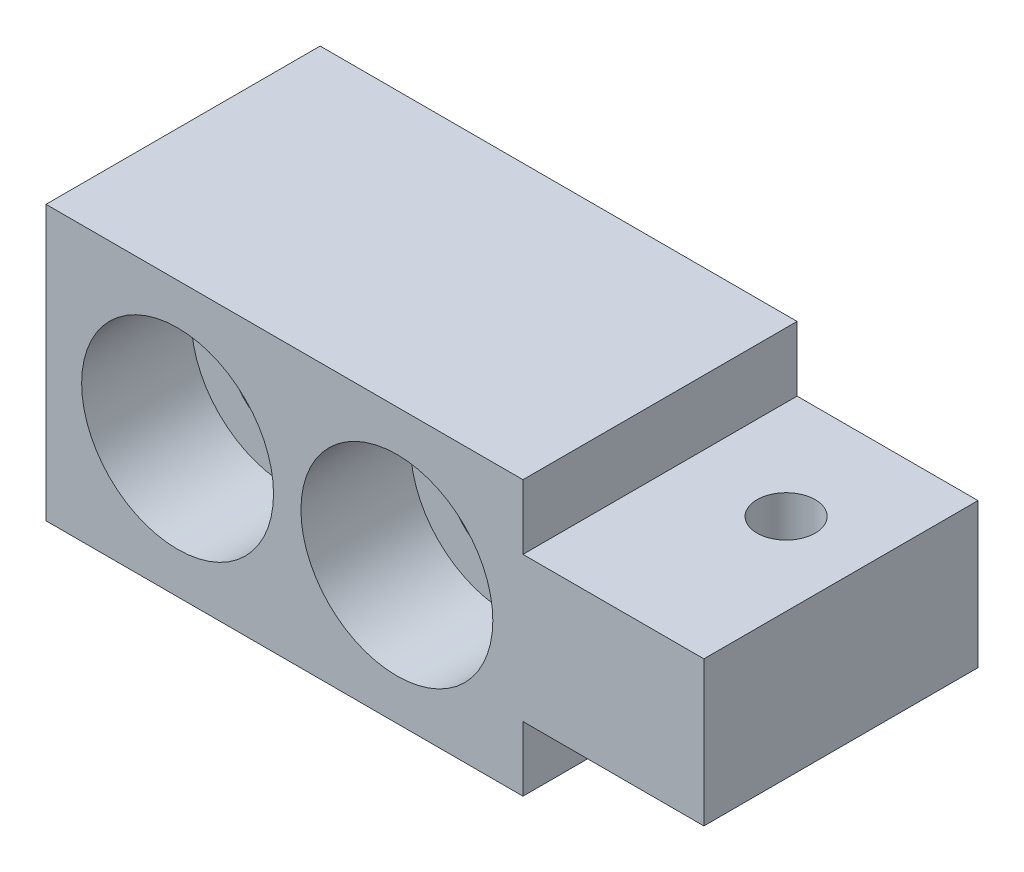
ISO-10303-21;
HEADER;
FILE_DESCRIPTION(('STEP AP214'),'2;1');
FILE_NAME('part.step','',(''),(''),'','','');
FILE_SCHEMA(('AUTOMOTIVE_DESIGN { 1 0 10303 214 1 1 1 1 }'));
ENDSEC;
DATA;
#1=APPLICATION_CONTEXT('core data for automotive mechanical design processes');
#2=APPLICATION_PROTOCOL_DEFINITION('international standard','automotive_design',2000,#1);
#3=PRODUCT_CONTEXT('',#1,'mechanical');
#4=PRODUCT('Part','Part','',(#3));
#5=PRODUCT_RELATED_PRODUCT_CATEGORY('part','',(#4));
#6=PRODUCT_DEFINITION_FORMATION('','',#4);
#7=PRODUCT_DEFINITION_CONTEXT('part definition',#1,'design');
#8=PRODUCT_DEFINITION('design','',#6,#7);
#9=PRODUCT_DEFINITION_SHAPE('','',#8);
#10=(LENGTH_UNIT() NAMED_UNIT(*) SI_UNIT(.MILLI.,.METRE.));
#11=(NAMED_UNIT(*) PLANE_ANGLE_UNIT() SI_UNIT($,.RADIAN.));
#12=(NAMED_UNIT(*) SI_UNIT($,.STERADIAN.) SOLID_ANGLE_UNIT());
#13=UNCERTAINTY_MEASURE_WITH_UNIT(LENGTH_MEASURE(1.E-05),#10,'distance_accuracy_value','');
#14=(GEOMETRIC_REPRESENTATION_CONTEXT(3) GLOBAL_UNCERTAINTY_ASSIGNED_CONTEXT((#13)) GLOBAL_UNIT_ASSIGNED_CONTEXT((#10,
#11,#12)) REPRESENTATION_CONTEXT('',''));
#15=CARTESIAN_POINT('',(0.,0.,0.));
#16=DIRECTION('',(0.,0.,1.));
#17=DIRECTION('',(1.,0.,0.));
#18=AXIS2_PLACEMENT_3D('',#15,#16,#17);
#19=CARTESIAN_POINT('',(48.,12.5,25.));
#20=DIRECTION('',(0.,0.,-1.));
#21=DIRECTION('',(1.,0.,0.));
#22=AXIS2_PLACEMENT_3D('',#19,#20,#21);
#23=PLANE('',#22);
#24=CARTESIAN_POINT('',(0.,0.,25.));
#25=DIRECTION('',(0.,0.,1.));
#26=DIRECTION('',(-1.,0.,0.));
#27=AXIS2_PLACEMENT_3D('',#24,#25,#26);
#28=CIRCLE('',#27,8.75);
#29=CARTESIAN_POINT('',(-8.75,0.,25.));
#30=VERTEX_POINT('',#29);
#31=EDGE_CURVE('E157',#30,#30,#28,.T.);
#32=ORIENTED_EDGE('',*,*,#31,.F.);
#33=EDGE_LOOP('',(#32));
#34=FACE_BOUND('',#33,.T.);
#35=DIRECTION('',(0.,1.,0.));
#36=VECTOR('',#35,1.);
#37=CARTESIAN_POINT('',(31.5,6.6,25.));
#38=LINE('',#37,#36);
#39=CARTESIAN_POINT('',(31.5,6.6,25.));
#40=VERTEX_POINT('',#39);
#41=CARTESIAN_POINT('',(31.5,12.5,25.));
#42=VERTEX_POINT('',#41);
#43=EDGE_CURVE('E88',#40,#42,#38,.T.);
#44=ORIENTED_EDGE('',*,*,#43,.T.);
#45=DIRECTION('',(-1.,0.,0.));
#46=VECTOR('',#45,1.);
#47=CARTESIAN_POINT('',(48.,12.5,25.));
#48=LINE('',#47,#46);
#49=CARTESIAN_POINT('',(-12.,12.5,25.));
#50=VERTEX_POINT('',#49);
#51=EDGE_CURVE('E22',#42,#50,#48,.T.);
#52=ORIENTED_EDGE('',*,*,#51,.T.);
#53=DIRECTION('',(0.,-1.,0.));
#54=VECTOR('',#53,1.);
#55=CARTESIAN_POINT('',(-12.,12.5,25.));
#56=LINE('',#55,#54);
#57=CARTESIAN_POINT('',(-12.,-12.5,25.));
#58=VERTEX_POINT('',#57);
#59=EDGE_CURVE('E129',#50,#58,#56,.T.);
#60=ORIENTED_EDGE('',*,*,#59,.T.);
#61=DIRECTION('',(-1.,0.,0.));
#62=VECTOR('',#61,1.);
#63=CARTESIAN_POINT('',(48.,-12.5,25.));
#64=LINE('',#63,#62);
#65=CARTESIAN_POINT('',(31.5,-12.5,25.));
#66=VERTEX_POINT('',#65);
#67=EDGE_CURVE('E140',#66,#58,#64,.T.);
#68=ORIENTED_EDGE('',*,*,#67,.F.);
#69=DIRECTION('',(0.,-1.,0.));
#70=VECTOR('',#69,1.);
#71=CARTESIAN_POINT('',(31.5,-6.6,25.));
#72=LINE('',#71,#70);
#73=CARTESIAN_POINT('',(31.5,-6.6,25.));
#74=VERTEX_POINT('',#73);
#75=EDGE_CURVE('E108',#74,#66,#72,.T.);
#76=ORIENTED_EDGE('',*,*,#75,.F.);
#77=DIRECTION('',(1.,0.,0.));
#78=VECTOR('',#77,1.);
#79=CARTESIAN_POINT('',(31.5,-6.6,25.));
#80=LINE('',#79,#78);
#81=CARTESIAN_POINT('',(48.,-6.6,25.));
#82=VERTEX_POINT('',#81);
#83=EDGE_CURVE('E110',#74,#82,#80,.T.);
#84=ORIENTED_EDGE('',*,*,#83,.T.);
#85=DIRECTION('',(0.,-1.,0.));
#86=VECTOR('',#85,1.);
#87=CARTESIAN_POINT('',(48.,12.5,25.));
#88=LINE('',#87,#86);
#89=CARTESIAN_POINT('',(48.,6.6,25.));
#90=VERTEX_POINT('',#89);
#91=EDGE_CURVE('E99',#90,#82,#88,.T.);
#92=ORIENTED_EDGE('',*,*,#91,.F.);
#93=DIRECTION('',(1.,0.,0.));
#94=VECTOR('',#93,1.);
#95=CARTESIAN_POINT('',(31.5,6.6,25.));
#96=LINE('',#95,#94);
#97=EDGE_CURVE('E82',#40,#90,#96,.T.);
#98=ORIENTED_EDGE('',*,*,#97,.F.);
#99=EDGE_LOOP('',(#44,#52,#60,#68,#76,#84,#92,#98));
#100=FACE_BOUND('',#99,.T.);
#101=CARTESIAN_POINT('',(20.,0.,25.));
#102=DIRECTION('',(0.,0.,1.));
#103=DIRECTION('',(-1.,0.,0.));
#104=AXIS2_PLACEMENT_3D('',#101,#102,#103);
#105=CIRCLE('',#104,8.75);
#106=CARTESIAN_POINT('',(11.25,0.,25.));
#107=VERTEX_POINT('',#106);
#108=EDGE_CURVE('E168',#107,#107,#105,.T.);
#109=ORIENTED_EDGE('',*,*,#108,.F.);
#110=EDGE_LOOP('',(#109));
#111=FACE_BOUND('',#110,.T.);
#112=ADVANCED_FACE('F14',(#34,#100,#111),#23,.F.);
#113=CARTESIAN_POINT('',(48.,-12.5,0.));
#114=DIRECTION('',(0.,0.,1.));
#115=DIRECTION('',(0.,1.,0.));
#116=AXIS2_PLACEMENT_3D('',#113,#114,#115);
#117=PLANE('',#116);
#118=CARTESIAN_POINT('',(0.,0.,0.));
#119=DIRECTION('',(0.,0.,1.));
#120=DIRECTION('',(0.,1.,0.));
#121=AXIS2_PLACEMENT_3D('',#118,#119,#120);
#122=CIRCLE('',#121,5.5);
#123=CARTESIAN_POINT('',(0.,5.5,0.));
#124=VERTEX_POINT('',#123);
#125=EDGE_CURVE('E145',#124,#124,#122,.F.);
#126=ORIENTED_EDGE('',*,*,#125,.F.);
#127=EDGE_LOOP('',(#126));
#128=FACE_BOUND('',#127,.T.);
#129=DIRECTION('',(0.,1.,0.));
#130=VECTOR('',#129,1.);
#131=CARTESIAN_POINT('',(31.5,6.6,0.));
#132=LINE('',#131,#130);
#133=CARTESIAN_POINT('',(31.5,6.6,0.));
#134=VERTEX_POINT('',#133);
#135=CARTESIAN_POINT('',(31.5,12.5,0.));
#136=VERTEX_POINT('',#135);
#137=EDGE_CURVE('E100',#134,#136,#132,.T.);
#138=ORIENTED_EDGE('',*,*,#137,.F.);
#139=DIRECTION('',(1.,0.,0.));
#140=VECTOR('',#139,1.);
#141=CARTESIAN_POINT('',(31.5,6.6,0.));
#142=LINE('',#141,#140);
#143=CARTESIAN_POINT('',(48.,6.6,0.));
#144=VERTEX_POINT('',#143);
#145=EDGE_CURVE('E83',#134,#144,#142,.T.);
#146=ORIENTED_EDGE('',*,*,#145,.T.);
#147=DIRECTION('',(0.,1.,0.));
#148=VECTOR('',#147,1.);
#149=CARTESIAN_POINT('',(48.,-12.5,0.));
#150=LINE('',#149,#148);
#151=CARTESIAN_POINT('',(48.,-6.6,0.));
#152=VERTEX_POINT('',#151);
#153=EDGE_CURVE('E132',#152,#144,#150,.T.);
#154=ORIENTED_EDGE('',*,*,#153,.F.);
#155=DIRECTION('',(1.,0.,0.));
#156=VECTOR('',#155,1.);
#157=CARTESIAN_POINT('',(31.5,-6.6,0.));
#158=LINE('',#157,#156);
#159=CARTESIAN_POINT('',(31.5,-6.6,0.));
#160=VERTEX_POINT('',#159);
#161=EDGE_CURVE('E38',#160,#152,#158,.T.);
#162=ORIENTED_EDGE('',*,*,#161,.F.);
#163=DIRECTION('',(0.,-1.,0.));
#164=VECTOR('',#163,1.);
#165=CARTESIAN_POINT('',(31.5,-6.6,0.));
#166=LINE('',#165,#164);
#167=CARTESIAN_POINT('',(31.5,-12.5,0.));
#168=VERTEX_POINT('',#167);
#169=EDGE_CURVE('E112',#160,#168,#166,.T.);
#170=ORIENTED_EDGE('',*,*,#169,.T.);
#171=DIRECTION('',(-1.,0.,0.));
#172=VECTOR('',#171,1.);
#173=CARTESIAN_POINT('',(48.,-12.5,0.));
#174=LINE('',#173,#172);
#175=CARTESIAN_POINT('',(-12.,-12.5,0.));
#176=VERTEX_POINT('',#175);
#177=EDGE_CURVE('E138',#168,#176,#174,.T.);
#178=ORIENTED_EDGE('',*,*,#177,.T.);
#179=DIRECTION('',(0.,1.,0.));
#180=VECTOR('',#179,1.);
#181=CARTESIAN_POINT('',(-12.,-12.5,0.));
#182=LINE('',#181,#180);
#183=CARTESIAN_POINT('',(-12.,12.5,0.));
#184=VERTEX_POINT('',#183);
#185=EDGE_CURVE('E123',#176,#184,#182,.T.);
#186=ORIENTED_EDGE('',*,*,#185,.T.);
#187=DIRECTION('',(-1.,0.,0.));
#188=VECTOR('',#187,1.);
#189=CARTESIAN_POINT('',(48.,12.5,0.));
#190=LINE('',#189,#188);
#191=EDGE_CURVE('E136',#136,#184,#190,.T.);
#192=ORIENTED_EDGE('',*,*,#191,.F.);
#193=EDGE_LOOP('',(#138,#146,#154,#162,#170,#178,#186,#192));
#194=FACE_BOUND('',#193,.T.);
#195=CARTESIAN_POINT('',(20.,0.,0.));
#196=DIRECTION('',(0.,0.,1.));
#197=DIRECTION('',(0.,1.,0.));
#198=AXIS2_PLACEMENT_3D('',#195,#196,#197);
#199=CIRCLE('',#198,5.5);
#200=CARTESIAN_POINT('',(20.,5.5,0.));
#201=VERTEX_POINT('',#200);
#202=EDGE_CURVE('E17',#201,#201,#199,.F.);
#203=ORIENTED_EDGE('',*,*,#202,.F.);
#204=EDGE_LOOP('',(#203));
#205=FACE_BOUND('',#204,.T.);
#206=ADVANCED_FACE('F175',(#128,#194,#205),#117,.F.);
#207=CARTESIAN_POINT('',(48.,12.5,25.));
#208=DIRECTION('',(0.,1.,0.));
#209=DIRECTION('',(0.,0.,-1.));
#210=AXIS2_PLACEMENT_3D('',#207,#208,#209);
#211=PLANE('',#210);
#212=ORIENTED_EDGE('',*,*,#51,.F.);
#213=DIRECTION('',(0.,0.,-1.));
#214=VECTOR('',#213,1.);
#215=CARTESIAN_POINT('',(31.5,12.5,25.));
#216=LINE('',#215,#214);
#217=EDGE_CURVE('E91',#42,#136,#216,.T.);
#218=ORIENTED_EDGE('',*,*,#217,.T.);
#219=ORIENTED_EDGE('',*,*,#191,.T.);
#220=DIRECTION('',(0.,0.,-1.));
#221=VECTOR('',#220,1.);
#222=CARTESIAN_POINT('',(-12.,12.5,25.));
#223=LINE('',#222,#221);
#224=EDGE_CURVE('E120',#50,#184,#223,.T.);
#225=ORIENTED_EDGE('',*,*,#224,.F.);
#226=EDGE_LOOP('',(#212,#218,#219,#225));
#227=FACE_BOUND('',#226,.T.);
#228=ADVANCED_FACE('F182',(#227),#211,.T.);
#229=CARTESIAN_POINT('',(48.,12.5,0.));
#230=DIRECTION('',(1.,0.,0.));
#231=DIRECTION('',(0.,1.,0.));
#232=AXIS2_PLACEMENT_3D('',#229,#230,#231);
#233=PLANE('',#232);
#234=DIRECTION('',(0.,0.,-1.));
#235=VECTOR('',#234,1.);
#236=CARTESIAN_POINT('',(48.,6.6,0.));
#237=LINE('',#236,#235);
#238=EDGE_CURVE('E30',#90,#144,#237,.T.);
#239=ORIENTED_EDGE('',*,*,#238,.F.);
#240=ORIENTED_EDGE('',*,*,#91,.T.);
#241=DIRECTION('',(0.,0.,-1.));
#242=VECTOR('',#241,1.);
#243=CARTESIAN_POINT('',(48.,-6.6,0.));
#244=LINE('',#243,#242);
#245=EDGE_CURVE('E9',#82,#152,#244,.T.);
#246=ORIENTED_EDGE('',*,*,#245,.T.);
#247=ORIENTED_EDGE('',*,*,#153,.T.);
#248=EDGE_LOOP('',(#239,#240,#246,#247));
#249=FACE_BOUND('',#248,.T.);
#250=ADVANCED_FACE('F228',(#249),#233,.T.);
#251=CARTESIAN_POINT('',(48.,-12.5,0.));
#252=DIRECTION('',(0.,-1.,0.));
#253=DIRECTION('',(1.,0.,0.));
#254=AXIS2_PLACEMENT_3D('',#251,#252,#253);
#255=PLANE('',#254);
#256=DIRECTION('',(0.,0.,-1.));
#257=VECTOR('',#256,1.);
#258=CARTESIAN_POINT('',(31.5,-12.5,0.));
#259=LINE('',#258,#257);
#260=EDGE_CURVE('E118',#66,#168,#259,.T.);
#261=ORIENTED_EDGE('',*,*,#260,.F.);
#262=ORIENTED_EDGE('',*,*,#67,.T.);
#263=DIRECTION('',(0.,0.,1.));
#264=VECTOR('',#263,1.);
#265=CARTESIAN_POINT('',(-12.,-12.5,0.));
#266=LINE('',#265,#264);
#267=EDGE_CURVE('E126',#176,#58,#266,.T.);
#268=ORIENTED_EDGE('',*,*,#267,.F.);
#269=ORIENTED_EDGE('',*,*,#177,.F.);
#270=EDGE_LOOP('',(#261,#262,#268,#269));
#271=FACE_BOUND('',#270,.T.);
#272=ADVANCED_FACE('F226',(#271),#255,.T.);
#273=CARTESIAN_POINT('',(-12.,12.5,0.));
#274=DIRECTION('',(1.,0.,0.));
#275=DIRECTION('',(0.,1.,0.));
#276=AXIS2_PLACEMENT_3D('',#273,#274,#275);
#277=PLANE('',#276);
#278=ORIENTED_EDGE('',*,*,#224,.T.);
#279=ORIENTED_EDGE('',*,*,#185,.F.);
#280=ORIENTED_EDGE('',*,*,#267,.T.);
#281=ORIENTED_EDGE('',*,*,#59,.F.);
#282=EDGE_LOOP('',(#278,#279,#280,#281));
#283=FACE_BOUND('',#282,.T.);
#284=ADVANCED_FACE('F222',(#283),#277,.F.);
#285=CARTESIAN_POINT('',(31.5,-6.6,0.));
#286=DIRECTION('',(-1.,0.,0.));
#287=DIRECTION('',(0.,-1.,0.));
#288=AXIS2_PLACEMENT_3D('',#285,#286,#287);
#289=PLANE('',#288);
#290=ORIENTED_EDGE('',*,*,#260,.T.);
#291=ORIENTED_EDGE('',*,*,#169,.F.);
#292=DIRECTION('',(0.,0.,1.));
#293=VECTOR('',#292,1.);
#294=CARTESIAN_POINT('',(31.5,-6.6,0.));
#295=LINE('',#294,#293);
#296=EDGE_CURVE('E116',#160,#74,#295,.T.);
#297=ORIENTED_EDGE('',*,*,#296,.T.);
#298=ORIENTED_EDGE('',*,*,#75,.T.);
#299=EDGE_LOOP('',(#290,#291,#297,#298));
#300=FACE_BOUND('',#299,.T.);
#301=ADVANCED_FACE('F218',(#300),#289,.F.);
#302=CARTESIAN_POINT('',(31.5,-6.6,0.));
#303=DIRECTION('',(0.,-1.,0.));
#304=DIRECTION('',(1.,0.,0.));
#305=AXIS2_PLACEMENT_3D('',#302,#303,#304);
#306=PLANE('',#305);
#307=CARTESIAN_POINT('',(40.5,-6.6,10.));
#308=DIRECTION('',(0.,-1.,0.));
#309=DIRECTION('',(1.,0.,0.));
#310=AXIS2_PLACEMENT_3D('',#307,#308,#309);
#311=CIRCLE('',#310,2.65);
#312=CARTESIAN_POINT('',(43.15,-6.6,10.));
#313=VERTEX_POINT('',#312);
#314=EDGE_CURVE('E144',#313,#313,#311,.T.);
#315=ORIENTED_EDGE('',*,*,#314,.F.);
#316=EDGE_LOOP('',(#315));
#317=FACE_BOUND('',#316,.T.);
#318=ORIENTED_EDGE('',*,*,#83,.F.);
#319=ORIENTED_EDGE('',*,*,#296,.F.);
#320=ORIENTED_EDGE('',*,*,#161,.T.);
#321=ORIENTED_EDGE('',*,*,#245,.F.);
#322=EDGE_LOOP('',(#318,#319,#320,#321));
#323=FACE_BOUND('',#322,.T.);
#324=ADVANCED_FACE('F212',(#317,#323),#306,.T.);
#325=CARTESIAN_POINT('',(31.5,6.6,0.));
#326=DIRECTION('',(1.,0.,0.));
#327=DIRECTION('',(0.,1.,0.));
#328=AXIS2_PLACEMENT_3D('',#325,#326,#327);
#329=PLANE('',#328);
#330=ORIENTED_EDGE('',*,*,#43,.F.);
#331=DIRECTION('',(0.,0.,1.));
#332=VECTOR('',#331,1.);
#333=CARTESIAN_POINT('',(31.5,6.6,0.));
#334=LINE('',#333,#332);
#335=EDGE_CURVE('E78',#134,#40,#334,.T.);
#336=ORIENTED_EDGE('',*,*,#335,.F.);
#337=ORIENTED_EDGE('',*,*,#137,.T.);
#338=ORIENTED_EDGE('',*,*,#217,.F.);
#339=EDGE_LOOP('',(#330,#336,#337,#338));
#340=FACE_BOUND('',#339,.T.);
#341=ADVANCED_FACE('F89',(#340),#329,.T.);
#342=CARTESIAN_POINT('',(31.5,6.6,0.));
#343=DIRECTION('',(0.,-1.,0.));
#344=DIRECTION('',(1.,0.,0.));
#345=AXIS2_PLACEMENT_3D('',#342,#343,#344);
#346=PLANE('',#345);
#347=CARTESIAN_POINT('',(40.5,6.6,10.));
#348=DIRECTION('',(0.,-1.,0.));
#349=DIRECTION('',(1.,0.,0.));
#350=AXIS2_PLACEMENT_3D('',#347,#348,#349);
#351=CIRCLE('',#350,2.65);
#352=CARTESIAN_POINT('',(43.15,6.6,10.));
#353=VERTEX_POINT('',#352);
#354=EDGE_CURVE('E94',#353,#353,#351,.T.);
#355=ORIENTED_EDGE('',*,*,#354,.T.);
#356=EDGE_LOOP('',(#355));
#357=FACE_BOUND('',#356,.T.);
#358=ORIENTED_EDGE('',*,*,#238,.T.);
#359=ORIENTED_EDGE('',*,*,#145,.F.);
#360=ORIENTED_EDGE('',*,*,#335,.T.);
#361=ORIENTED_EDGE('',*,*,#97,.T.);
#362=EDGE_LOOP('',(#358,#359,#360,#361));
#363=FACE_BOUND('',#362,.T.);
#364=ADVANCED_FACE('F80',(#357,#363),#346,.F.);
#365=CARTESIAN_POINT('',(40.5,12.5,10.));
#366=DIRECTION('',(0.,-1.,0.));
#367=DIRECTION('',(1.,0.,0.));
#368=AXIS2_PLACEMENT_3D('',#365,#366,#367);
#369=CYLINDRICAL_SURFACE('',#368,2.65);
#370=ORIENTED_EDGE('',*,*,#314,.T.);
#371=EDGE_LOOP('',(#370));
#372=FACE_BOUND('',#371,.T.);
#373=ORIENTED_EDGE('',*,*,#354,.F.);
#374=EDGE_LOOP('',(#373));
#375=FACE_BOUND('',#374,.T.);
#376=ADVANCED_FACE('F203',(#372,#375),#369,.F.);
#377=CARTESIAN_POINT('',(0.,0.,25.));
#378=DIRECTION('',(0.,0.,1.));
#379=DIRECTION('',(-1.,0.,0.));
#380=AXIS2_PLACEMENT_3D('',#377,#378,#379);
#381=CYLINDRICAL_SURFACE('',#380,5.5);
#382=CARTESIAN_POINT('',(0.,0.,15.));
#383=DIRECTION('',(0.,0.,1.));
#384=DIRECTION('',(-1.,0.,0.));
#385=AXIS2_PLACEMENT_3D('',#382,#383,#384);
#386=CIRCLE('',#385,5.5);
#387=CARTESIAN_POINT('',(-5.5,0.,15.));
#388=VERTEX_POINT('',#387);
#389=EDGE_CURVE('E147',#388,#388,#386,.T.);
#390=ORIENTED_EDGE('',*,*,#389,.T.);
#391=EDGE_LOOP('',(#390));
#392=FACE_BOUND('',#391,.T.);
#393=ORIENTED_EDGE('',*,*,#125,.T.);
#394=EDGE_LOOP('',(#393));
#395=FACE_BOUND('',#394,.T.);
#396=ADVANCED_FACE('F197',(#392,#395),#381,.F.);
#397=CARTESIAN_POINT('',(0.,-5.5,15.));
#398=DIRECTION('',(0.,0.,1.));
#399=DIRECTION('',(-1.,0.,0.));
#400=AXIS2_PLACEMENT_3D('',#397,#398,#399);
#401=PLANE('',#400);
#402=CARTESIAN_POINT('',(0.,0.,15.));
#403=DIRECTION('',(0.,0.,1.));
#404=DIRECTION('',(-1.,0.,0.));
#405=AXIS2_PLACEMENT_3D('',#402,#403,#404);
#406=CIRCLE('',#405,8.75);
#407=CARTESIAN_POINT('',(-8.75,0.,15.));
#408=VERTEX_POINT('',#407);
#409=EDGE_CURVE('E152',#408,#408,#406,.T.);
#410=ORIENTED_EDGE('',*,*,#409,.T.);
#411=EDGE_LOOP('',(#410));
#412=FACE_BOUND('',#411,.T.);
#413=ORIENTED_EDGE('',*,*,#389,.F.);
#414=EDGE_LOOP('',(#413));
#415=FACE_BOUND('',#414,.T.);
#416=ADVANCED_FACE('F191',(#412,#415),#401,.T.);
#417=CARTESIAN_POINT('',(0.,0.,25.));
#418=DIRECTION('',(0.,0.,1.));
#419=DIRECTION('',(-1.,0.,0.));
#420=AXIS2_PLACEMENT_3D('',#417,#418,#419);
#421=CYLINDRICAL_SURFACE('',#420,8.75);
#422=ORIENTED_EDGE('',*,*,#31,.T.);
#423=EDGE_LOOP('',(#422));
#424=FACE_BOUND('',#423,.T.);
#425=ORIENTED_EDGE('',*,*,#409,.F.);
#426=EDGE_LOOP('',(#425));
#427=FACE_BOUND('',#426,.T.);
#428=ADVANCED_FACE('F187',(#424,#427),#421,.F.);
#429=CARTESIAN_POINT('',(20.,0.,25.));
#430=DIRECTION('',(0.,0.,1.));
#431=DIRECTION('',(-1.,0.,0.));
#432=AXIS2_PLACEMENT_3D('',#429,#430,#431);
#433=CYLINDRICAL_SURFACE('',#432,5.5);
#434=CARTESIAN_POINT('',(20.,0.,15.));
#435=DIRECTION('',(0.,0.,1.));
#436=DIRECTION('',(-1.,0.,0.));
#437=AXIS2_PLACEMENT_3D('',#434,#435,#436);
#438=CIRCLE('',#437,5.5);
#439=CARTESIAN_POINT('',(14.5,0.,15.));
#440=VERTEX_POINT('',#439);
#441=EDGE_CURVE('E162',#440,#440,#438,.T.);
#442=ORIENTED_EDGE('',*,*,#441,.T.);
#443=EDGE_LOOP('',(#442));
#444=FACE_BOUND('',#443,.T.);
#445=ORIENTED_EDGE('',*,*,#202,.T.);
#446=EDGE_LOOP('',(#445));
#447=FACE_BOUND('',#446,.T.);
#448=ADVANCED_FACE('F190',(#444,#447),#433,.F.);
#449=CARTESIAN_POINT('',(20.,-5.5,15.));
#450=DIRECTION('',(0.,0.,1.));
#451=DIRECTION('',(-1.,0.,0.));
#452=AXIS2_PLACEMENT_3D('',#449,#450,#451);
#453=PLANE('',#452);
#454=CARTESIAN_POINT('',(20.,0.,15.));
#455=DIRECTION('',(0.,0.,1.));
#456=DIRECTION('',(-1.,0.,0.));
#457=AXIS2_PLACEMENT_3D('',#454,#455,#456);
#458=CIRCLE('',#457,8.75);
#459=CARTESIAN_POINT('',(11.25,0.,15.));
#460=VERTEX_POINT('',#459);
#461=EDGE_CURVE('E165',#460,#460,#458,.T.);
#462=ORIENTED_EDGE('',*,*,#461,.T.);
#463=EDGE_LOOP('',(#462));
#464=FACE_BOUND('',#463,.T.);
#465=ORIENTED_EDGE('',*,*,#441,.F.);
#466=EDGE_LOOP('',(#465));
#467=FACE_BOUND('',#466,.T.);
#468=ADVANCED_FACE('F257',(#464,#467),#453,.T.);
#469=CARTESIAN_POINT('',(20.,0.,25.));
#470=DIRECTION('',(0.,0.,1.));
#471=DIRECTION('',(-1.,0.,0.));
#472=AXIS2_PLACEMENT_3D('',#469,#470,#471);
#473=CYLINDRICAL_SURFACE('',#472,8.75);
#474=ORIENTED_EDGE('',*,*,#108,.T.);
#475=EDGE_LOOP('',(#474));
#476=FACE_BOUND('',#475,.T.);
#477=ORIENTED_EDGE('',*,*,#461,.F.);
#478=EDGE_LOOP('',(#477));
#479=FACE_BOUND('',#478,.T.);
#480=ADVANCED_FACE('F172',(#476,#479),#473,.F.);
#481=CLOSED_SHELL('',(#112,#206,#228,#250,#272,#284,#301,#324,#341,#364,#376,#396,#416,#428,
#448,#468,#480));
#482=MANIFOLD_SOLID_BREP('B1',#481);
#483=ADVANCED_BREP_SHAPE_REPRESENTATION('',(#18,#482),#14);
#484=SHAPE_DEFINITION_REPRESENTATION(#9,#483);
ENDSEC;
END-ISO-10303-21;
